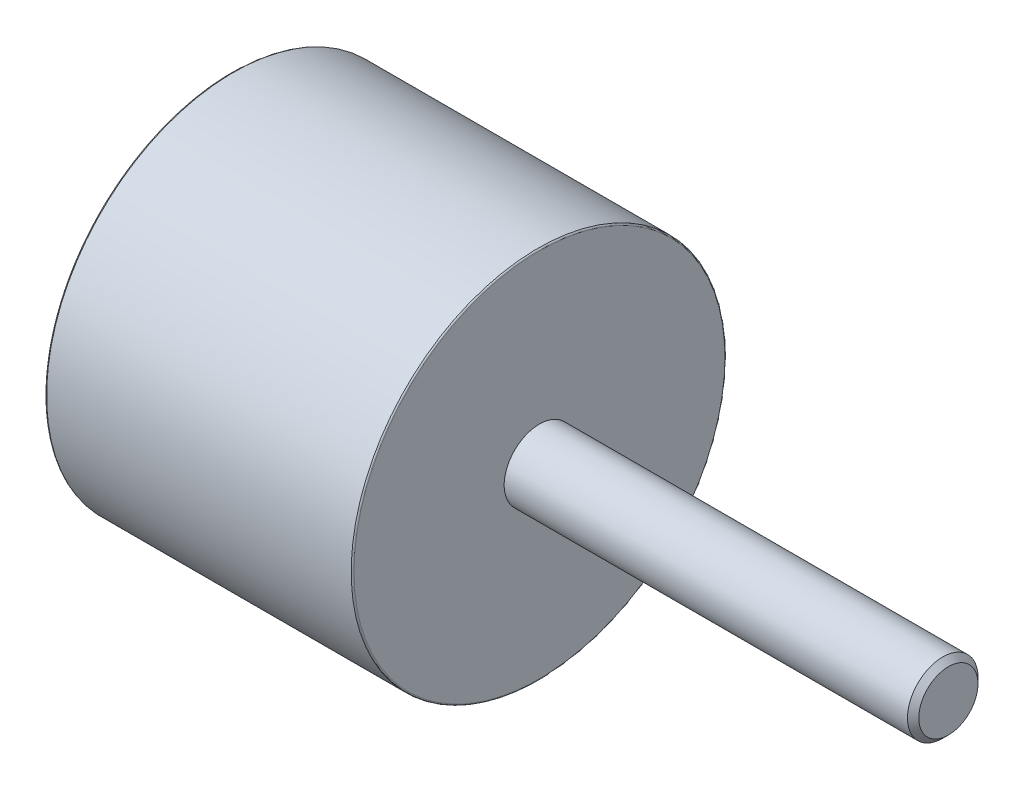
ISO-10303-21;
HEADER;
FILE_DESCRIPTION(('STEP AP214'),'2;1');
FILE_NAME('part.step','',(''),(''),'','','');
FILE_SCHEMA(('AUTOMOTIVE_DESIGN { 1 0 10303 214 1 1 1 1 }'));
ENDSEC;
DATA;
#1=APPLICATION_CONTEXT('core data for automotive mechanical design processes');
#2=APPLICATION_PROTOCOL_DEFINITION('international standard','automotive_design',2000,#1);
#3=PRODUCT_CONTEXT('',#1,'mechanical');
#4=PRODUCT('Part','Part','',(#3));
#5=PRODUCT_RELATED_PRODUCT_CATEGORY('part','',(#4));
#6=PRODUCT_DEFINITION_FORMATION('','',#4);
#7=PRODUCT_DEFINITION_CONTEXT('part definition',#1,'design');
#8=PRODUCT_DEFINITION('design','',#6,#7);
#9=PRODUCT_DEFINITION_SHAPE('','',#8);
#10=(LENGTH_UNIT() NAMED_UNIT(*) SI_UNIT(.MILLI.,.METRE.));
#11=(NAMED_UNIT(*) PLANE_ANGLE_UNIT() SI_UNIT($,.RADIAN.));
#12=(NAMED_UNIT(*) SI_UNIT($,.STERADIAN.) SOLID_ANGLE_UNIT());
#13=UNCERTAINTY_MEASURE_WITH_UNIT(LENGTH_MEASURE(1.E-05),#10,'distance_accuracy_value','');
#14=(GEOMETRIC_REPRESENTATION_CONTEXT(3) GLOBAL_UNCERTAINTY_ASSIGNED_CONTEXT((#13)) GLOBAL_UNIT_ASSIGNED_CONTEXT((#10,
#11,#12)) REPRESENTATION_CONTEXT('',''));
#15=CARTESIAN_POINT('',(0.,0.,0.));
#16=DIRECTION('',(0.,0.,1.));
#17=DIRECTION('',(1.,0.,0.));
#18=AXIS2_PLACEMENT_3D('',#15,#16,#17);
#19=CARTESIAN_POINT('',(-2.,0.,0.));
#20=DIRECTION('',(-1.,0.,0.));
#21=DIRECTION('',(0.,0.,1.));
#22=AXIS2_PLACEMENT_3D('',#19,#20,#21);
#23=PLANE('',#22);
#24=CARTESIAN_POINT('',(-2.00000000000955,0.,0.));
#25=DIRECTION('',(1.,0.,0.));
#26=DIRECTION('',(0.,0.,-1.));
#27=AXIS2_PLACEMENT_3D('',#24,#25,#26);
#28=CIRCLE('',#27,2.09999999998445);
#29=CARTESIAN_POINT('',(-2.00000000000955,0.,-2.09999999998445));
#30=VERTEX_POINT('',#29);
#31=EDGE_CURVE('E223',#30,#30,#28,.T.);
#32=ORIENTED_EDGE('',*,*,#31,.F.);
#33=EDGE_LOOP('',(#32));
#34=FACE_BOUND('',#33,.T.);
#35=ADVANCED_FACE('F17',(#34),#23,.T.);
#36=CARTESIAN_POINT('',(50.8,0.,0.));
#37=DIRECTION('',(1.,0.,0.));
#38=DIRECTION('',(0.,0.,-1.));
#39=AXIS2_PLACEMENT_3D('',#36,#37,#38);
#40=PLANE('',#39);
#41=CARTESIAN_POINT('',(50.7999999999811,0.,0.));
#42=DIRECTION('',(-1.,0.,0.));
#43=DIRECTION('',(0.,0.,1.));
#44=AXIS2_PLACEMENT_3D('',#41,#42,#43);
#45=CIRCLE('',#44,2.09999999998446);
#46=CARTESIAN_POINT('',(50.7999999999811,0.,2.09999999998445));
#47=VERTEX_POINT('',#46);
#48=EDGE_CURVE('E225',#47,#47,#45,.T.);
#49=ORIENTED_EDGE('',*,*,#48,.F.);
#50=EDGE_LOOP('',(#49));
#51=FACE_BOUND('',#50,.T.);
#52=ADVANCED_FACE('F176',(#51),#40,.T.);
#53=CARTESIAN_POINT('',(-1.59999999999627,0.,0.));
#54=DIRECTION('',(1.,0.,0.));
#55=DIRECTION('',(0.,0.,-1.));
#56=AXIS2_PLACEMENT_3D('',#53,#54,#55);
#57=CONICAL_SURFACE('',#56,2.50000000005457,0.785398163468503);
#58=CARTESIAN_POINT('',(-1.6,0.,0.));
#59=DIRECTION('',(-1.,0.,0.));
#60=DIRECTION('',(0.,0.,1.));
#61=AXIS2_PLACEMENT_3D('',#58,#59,#60);
#62=CIRCLE('',#61,2.5);
#63=CARTESIAN_POINT('',(-1.6,0.,2.5));
#64=VERTEX_POINT('',#63);
#65=EDGE_CURVE('E228',#64,#64,#62,.F.);
#66=ORIENTED_EDGE('',*,*,#65,.F.);
#67=EDGE_LOOP('',(#66));
#68=FACE_BOUND('',#67,.T.);
#69=ORIENTED_EDGE('',*,*,#31,.T.);
#70=EDGE_LOOP('',(#69));
#71=FACE_BOUND('',#70,.T.);
#72=ADVANCED_FACE('F168',(#68,#71),#57,.T.);
#73=CARTESIAN_POINT('',(50.3999999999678,0.,0.));
#74=DIRECTION('',(-1.,0.,0.));
#75=DIRECTION('',(0.,0.,1.));
#76=AXIS2_PLACEMENT_3D('',#73,#74,#75);
#77=CONICAL_SURFACE('',#76,2.50000000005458,0.785398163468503);
#78=CARTESIAN_POINT('',(50.4,0.,0.));
#79=DIRECTION('',(1.,0.,0.));
#80=DIRECTION('',(0.,0.,-1.));
#81=AXIS2_PLACEMENT_3D('',#78,#79,#80);
#82=CIRCLE('',#81,2.5);
#83=CARTESIAN_POINT('',(50.4,0.,-2.50000000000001));
#84=VERTEX_POINT('',#83);
#85=EDGE_CURVE('E242',#84,#84,#82,.F.);
#86=ORIENTED_EDGE('',*,*,#85,.F.);
#87=EDGE_LOOP('',(#86));
#88=FACE_BOUND('',#87,.T.);
#89=ORIENTED_EDGE('',*,*,#48,.T.);
#90=EDGE_LOOP('',(#89));
#91=FACE_BOUND('',#90,.T.);
#92=ADVANCED_FACE('F160',(#88,#91),#77,.T.);
#93=CARTESIAN_POINT('',(-1.,0.,0.));
#94=DIRECTION('',(-1.,0.,0.));
#95=DIRECTION('',(0.,0.,1.));
#96=AXIS2_PLACEMENT_3D('',#93,#94,#95);
#97=CYLINDRICAL_SURFACE('',#96,2.5);
#98=ORIENTED_EDGE('',*,*,#65,.T.);
#99=EDGE_LOOP('',(#98));
#100=FACE_BOUND('',#99,.T.);
#101=CARTESIAN_POINT('',(0.,0.,0.));
#102=DIRECTION('',(-1.,0.,0.));
#103=DIRECTION('',(0.,0.,1.));
#104=AXIS2_PLACEMENT_3D('',#101,#102,#103);
#105=CIRCLE('',#104,2.5);
#106=CARTESIAN_POINT('',(0.,0.,2.5));
#107=VERTEX_POINT('',#106);
#108=EDGE_CURVE('E239',#107,#107,#105,.F.);
#109=ORIENTED_EDGE('',*,*,#108,.F.);
#110=EDGE_LOOP('',(#109));
#111=FACE_BOUND('',#110,.T.);
#112=ADVANCED_FACE('F152',(#100,#111),#97,.T.);
#113=CARTESIAN_POINT('',(36.3,0.,0.));
#114=DIRECTION('',(1.,0.,0.));
#115=DIRECTION('',(0.,0.,-1.));
#116=AXIS2_PLACEMENT_3D('',#113,#114,#115);
#117=CYLINDRICAL_SURFACE('',#116,2.5);
#118=ORIENTED_EDGE('',*,*,#85,.T.);
#119=EDGE_LOOP('',(#118));
#120=FACE_BOUND('',#119,.T.);
#121=CARTESIAN_POINT('',(21.8,0.,0.));
#122=DIRECTION('',(1.,0.,0.));
#123=DIRECTION('',(0.,0.,-1.));
#124=AXIS2_PLACEMENT_3D('',#121,#122,#123);
#125=CIRCLE('',#124,2.5);
#126=CARTESIAN_POINT('',(21.8,0.,-2.5));
#127=VERTEX_POINT('',#126);
#128=EDGE_CURVE('E53',#127,#127,#125,.F.);
#129=ORIENTED_EDGE('',*,*,#128,.F.);
#130=EDGE_LOOP('',(#129));
#131=FACE_BOUND('',#130,.T.);
#132=ADVANCED_FACE('F146',(#120,#131),#117,.T.);
#133=CARTESIAN_POINT('',(0.,0.,0.));
#134=DIRECTION('',(-1.,0.,0.));
#135=DIRECTION('',(0.,0.,1.));
#136=AXIS2_PLACEMENT_3D('',#133,#134,#135);
#137=PLANE('',#136);
#138=CARTESIAN_POINT('',(0.,0.,0.));
#139=DIRECTION('',(1.,0.,0.));
#140=DIRECTION('',(0.,0.,1.));
#141=AXIS2_PLACEMENT_3D('',#138,#139,#140);
#142=CIRCLE('',#141,13.15);
#143=CARTESIAN_POINT('',(0.,0.,13.15));
#144=VERTEX_POINT('',#143);
#145=CARTESIAN_POINT('',(0.,0.,-13.15));
#146=VERTEX_POINT('',#145);
#147=EDGE_CURVE('E45',#144,#146,#142,.T.);
#148=ORIENTED_EDGE('',*,*,#147,.F.);
#149=CARTESIAN_POINT('',(0.,0.,0.));
#150=DIRECTION('',(1.,0.,0.));
#151=DIRECTION('',(0.,0.,-1.));
#152=AXIS2_PLACEMENT_3D('',#149,#150,#151);
#153=CIRCLE('',#152,13.15);
#154=EDGE_CURVE('E51',#146,#144,#153,.T.);
#155=ORIENTED_EDGE('',*,*,#154,.F.);
#156=EDGE_LOOP('',(#148,#155));
#157=FACE_BOUND('',#156,.T.);
#158=ORIENTED_EDGE('',*,*,#108,.T.);
#159=EDGE_LOOP('',(#158));
#160=FACE_BOUND('',#159,.T.);
#161=ADVANCED_FACE('F49',(#157,#160),#137,.T.);
#162=CARTESIAN_POINT('',(21.8,0.,0.));
#163=DIRECTION('',(1.,0.,0.));
#164=DIRECTION('',(0.,0.,-1.));
#165=AXIS2_PLACEMENT_3D('',#162,#163,#164);
#166=PLANE('',#165);
#167=CARTESIAN_POINT('',(21.8,0.,0.));
#168=DIRECTION('',(-1.,0.,0.));
#169=DIRECTION('',(0.,0.,-1.));
#170=AXIS2_PLACEMENT_3D('',#167,#168,#169);
#171=CIRCLE('',#170,13.15);
#172=CARTESIAN_POINT('',(21.8,0.,-13.15));
#173=VERTEX_POINT('',#172);
#174=CARTESIAN_POINT('',(21.8,0.,13.15));
#175=VERTEX_POINT('',#174);
#176=EDGE_CURVE('E36',#173,#175,#171,.T.);
#177=ORIENTED_EDGE('',*,*,#176,.F.);
#178=CARTESIAN_POINT('',(21.8,0.,0.));
#179=DIRECTION('',(-1.,0.,0.));
#180=DIRECTION('',(0.,0.,1.));
#181=AXIS2_PLACEMENT_3D('',#178,#179,#180);
#182=CIRCLE('',#181,13.15);
#183=EDGE_CURVE('E58',#175,#173,#182,.T.);
#184=ORIENTED_EDGE('',*,*,#183,.F.);
#185=EDGE_LOOP('',(#177,#184));
#186=FACE_BOUND('',#185,.T.);
#187=ORIENTED_EDGE('',*,*,#128,.T.);
#188=EDGE_LOOP('',(#187));
#189=FACE_BOUND('',#188,.T.);
#190=ADVANCED_FACE('F79',(#186,#189),#166,.T.);
#191=CARTESIAN_POINT('',(0.1,0.,0.));
#192=DIRECTION('',(-1.,0.,0.));
#193=DIRECTION('',(0.,0.,1.));
#194=AXIS2_PLACEMENT_3D('',#191,#192,#193);
#195=TOROIDAL_SURFACE('',#194,13.15,0.1);
#196=ORIENTED_EDGE('',*,*,#147,.T.);
#197=ORIENTED_EDGE('',*,*,#154,.T.);
#198=EDGE_LOOP('',(#196,#197));
#199=FACE_BOUND('',#198,.T.);
#200=CARTESIAN_POINT('',(0.100000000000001,0.,0.));
#201=DIRECTION('',(1.,0.,0.));
#202=DIRECTION('',(0.,0.,-1.));
#203=AXIS2_PLACEMENT_3D('',#200,#201,#202);
#204=CIRCLE('',#203,13.25);
#205=CARTESIAN_POINT('',(0.0999999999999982,0.,-13.25));
#206=VERTEX_POINT('',#205);
#207=EDGE_CURVE('E28',#206,#206,#204,.T.);
#208=ORIENTED_EDGE('',*,*,#207,.F.);
#209=EDGE_LOOP('',(#208));
#210=FACE_BOUND('',#209,.T.);
#211=ADVANCED_FACE('F56',(#199,#210),#195,.T.);
#212=CARTESIAN_POINT('',(21.7,0.,0.));
#213=DIRECTION('',(1.,0.,0.));
#214=DIRECTION('',(0.,0.,-1.));
#215=AXIS2_PLACEMENT_3D('',#212,#213,#214);
#216=TOROIDAL_SURFACE('',#215,13.15,0.1);
#217=ORIENTED_EDGE('',*,*,#176,.T.);
#218=ORIENTED_EDGE('',*,*,#183,.T.);
#219=EDGE_LOOP('',(#217,#218));
#220=FACE_BOUND('',#219,.T.);
#221=CARTESIAN_POINT('',(21.7,0.,0.));
#222=DIRECTION('',(1.,0.,0.));
#223=DIRECTION('',(0.,0.,-1.));
#224=AXIS2_PLACEMENT_3D('',#221,#222,#223);
#225=CIRCLE('',#224,13.25);
#226=CARTESIAN_POINT('',(21.7,0.,-13.25));
#227=VERTEX_POINT('',#226);
#228=EDGE_CURVE('E11',#227,#227,#225,.F.);
#229=ORIENTED_EDGE('',*,*,#228,.F.);
#230=EDGE_LOOP('',(#229));
#231=FACE_BOUND('',#230,.T.);
#232=ADVANCED_FACE('F78',(#220,#231),#216,.T.);
#233=CARTESIAN_POINT('',(10.9,0.,0.));
#234=DIRECTION('',(1.,0.,0.));
#235=DIRECTION('',(0.,0.,-1.));
#236=AXIS2_PLACEMENT_3D('',#233,#234,#235);
#237=CYLINDRICAL_SURFACE('',#236,13.25);
#238=ORIENTED_EDGE('',*,*,#228,.T.);
#239=EDGE_LOOP('',(#238));
#240=FACE_BOUND('',#239,.T.);
#241=ORIENTED_EDGE('',*,*,#207,.T.);
#242=EDGE_LOOP('',(#241));
#243=FACE_BOUND('',#242,.T.);
#244=ADVANCED_FACE('F119',(#240,#243),#237,.T.);
#245=CLOSED_SHELL('',(#35,#52,#72,#92,#112,#132,#161,#190,#211,#232,#244));
#246=MANIFOLD_SOLID_BREP('B1',#245);
#247=ADVANCED_BREP_SHAPE_REPRESENTATION('',(#18,#246),#14);
#248=SHAPE_DEFINITION_REPRESENTATION(#9,#247);
ENDSEC;
END-ISO-10303-21;
